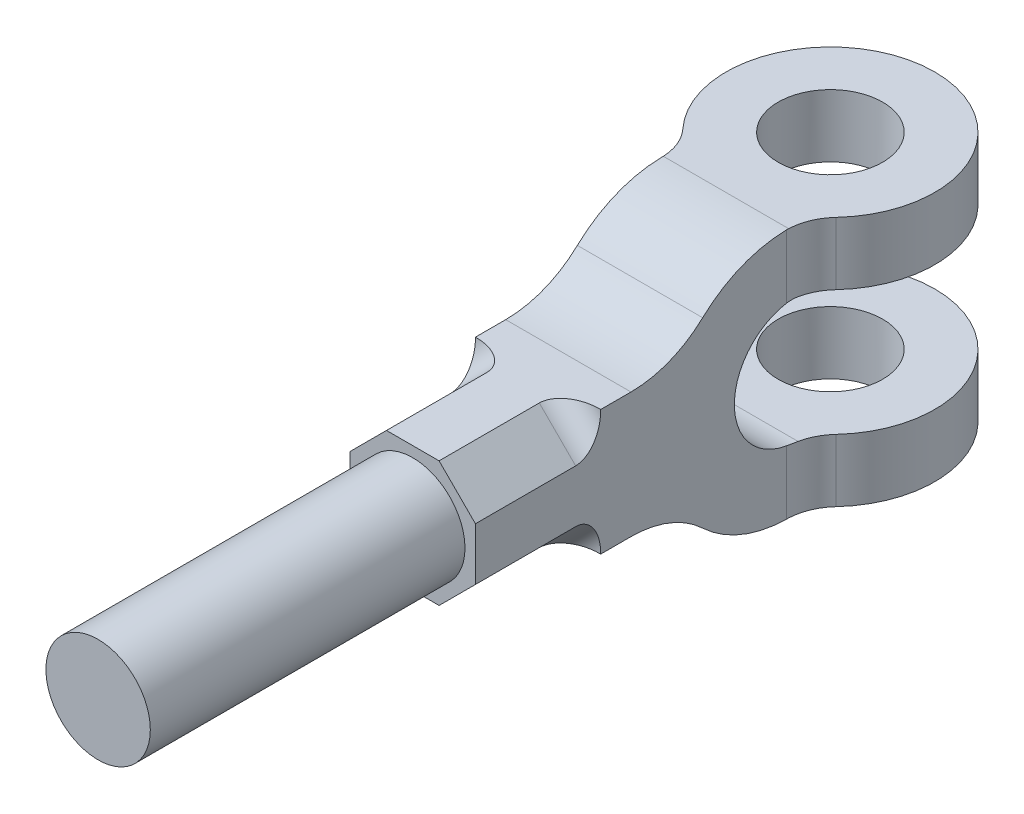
ISO-10303-21;
HEADER;
FILE_DESCRIPTION(('STEP AP214'),'2;1');
FILE_NAME('part.step','',(''),(''),'','','');
FILE_SCHEMA(('AUTOMOTIVE_DESIGN { 1 0 10303 214 1 1 1 1 }'));
ENDSEC;
DATA;
#1=APPLICATION_CONTEXT('core data for automotive mechanical design processes');
#2=APPLICATION_PROTOCOL_DEFINITION('international standard','automotive_design',2000,#1);
#3=PRODUCT_CONTEXT('',#1,'mechanical');
#4=PRODUCT('Part','Part','',(#3));
#5=PRODUCT_RELATED_PRODUCT_CATEGORY('part','',(#4));
#6=PRODUCT_DEFINITION_FORMATION('','',#4);
#7=PRODUCT_DEFINITION_CONTEXT('part definition',#1,'design');
#8=PRODUCT_DEFINITION('design','',#6,#7);
#9=PRODUCT_DEFINITION_SHAPE('','',#8);
#10=(LENGTH_UNIT() NAMED_UNIT(*) SI_UNIT(.MILLI.,.METRE.));
#11=(NAMED_UNIT(*) PLANE_ANGLE_UNIT() SI_UNIT($,.RADIAN.));
#12=(NAMED_UNIT(*) SI_UNIT($,.STERADIAN.) SOLID_ANGLE_UNIT());
#13=UNCERTAINTY_MEASURE_WITH_UNIT(LENGTH_MEASURE(1.E-05),#10,'distance_accuracy_value','');
#14=(GEOMETRIC_REPRESENTATION_CONTEXT(3) GLOBAL_UNCERTAINTY_ASSIGNED_CONTEXT((#13)) GLOBAL_UNIT_ASSIGNED_CONTEXT((#10,
#11,#12)) REPRESENTATION_CONTEXT('',''));
#15=CARTESIAN_POINT('',(0.,0.,0.));
#16=DIRECTION('',(0.,0.,1.));
#17=DIRECTION('',(1.,0.,0.));
#18=AXIS2_PLACEMENT_3D('',#15,#16,#17);
#19=CARTESIAN_POINT('',(100.,0.,250.));
#20=DIRECTION('',(0.,0.,-1.));
#21=DIRECTION('',(0.,1.,0.));
#22=AXIS2_PLACEMENT_3D('',#19,#20,#21);
#23=PLANE('',#22);
#24=CARTESIAN_POINT('',(50.,-60.,250.));
#25=DIRECTION('',(0.,0.,1.));
#26=DIRECTION('',(1.,0.,0.));
#27=AXIS2_PLACEMENT_3D('',#24,#25,#26);
#28=CIRCLE('',#27,25.);
#29=CARTESIAN_POINT('',(75.,-60.,250.));
#30=VERTEX_POINT('',#29);
#31=EDGE_CURVE('E580',#30,#30,#28,.T.);
#32=ORIENTED_EDGE('',*,*,#31,.F.);
#33=EDGE_LOOP('',(#32));
#34=FACE_BOUND('',#33,.T.);
#35=DIRECTION('',(0.707106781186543,-0.707106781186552,0.));
#36=VECTOR('',#35,1.);
#37=CARTESIAN_POINT('',(-26.3,-26.2999999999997,250.));
#38=LINE('',#37,#36);
#39=CARTESIAN_POINT('',(20.,-72.6000000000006,250.));
#40=VERTEX_POINT('',#39);
#41=CARTESIAN_POINT('',(37.3999999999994,-90.,250.));
#42=VERTEX_POINT('',#41);
#43=EDGE_CURVE('E616',#40,#42,#38,.T.);
#44=ORIENTED_EDGE('',*,*,#43,.T.);
#45=DIRECTION('',(1.,0.,0.));
#46=VECTOR('',#45,1.);
#47=CARTESIAN_POINT('',(0.,-90.,250.));
#48=LINE('',#47,#46);
#49=CARTESIAN_POINT('',(62.6000000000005,-90.,250.));
#50=VERTEX_POINT('',#49);
#51=EDGE_CURVE('E752',#42,#50,#48,.T.);
#52=ORIENTED_EDGE('',*,*,#51,.T.);
#53=DIRECTION('',(0.70710678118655,0.707106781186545,0.));
#54=VECTOR('',#53,1.);
#55=CARTESIAN_POINT('',(76.3000000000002,-76.3000000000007,250.));
#56=LINE('',#55,#54);
#57=CARTESIAN_POINT('',(80.,-72.6000000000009,250.));
#58=VERTEX_POINT('',#57);
#59=EDGE_CURVE('E604',#50,#58,#56,.T.);
#60=ORIENTED_EDGE('',*,*,#59,.T.);
#61=DIRECTION('',(0.,1.,0.));
#62=VECTOR('',#61,1.);
#63=CARTESIAN_POINT('',(80.,-120.,250.));
#64=LINE('',#63,#62);
#65=CARTESIAN_POINT('',(80.,-47.4,250.));
#66=VERTEX_POINT('',#65);
#67=EDGE_CURVE('E697',#58,#66,#64,.T.);
#68=ORIENTED_EDGE('',*,*,#67,.T.);
#69=DIRECTION('',(-0.707106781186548,0.707106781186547,0.));
#70=VECTOR('',#69,1.);
#71=CARTESIAN_POINT('',(16.3,16.3,250.));
#72=LINE('',#71,#70);
#73=CARTESIAN_POINT('',(62.6,-30.,250.));
#74=VERTEX_POINT('',#73);
#75=EDGE_CURVE('E365',#66,#74,#72,.T.);
#76=ORIENTED_EDGE('',*,*,#75,.T.);
#77=DIRECTION('',(1.,0.,0.));
#78=VECTOR('',#77,1.);
#79=CARTESIAN_POINT('',(0.,-30.,250.));
#80=LINE('',#79,#78);
#81=CARTESIAN_POINT('',(37.4000000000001,-30.,250.));
#82=VERTEX_POINT('',#81);
#83=EDGE_CURVE('E748',#82,#74,#80,.T.);
#84=ORIENTED_EDGE('',*,*,#83,.F.);
#85=DIRECTION('',(-0.707106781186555,-0.70710678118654,0.));
#86=VECTOR('',#85,1.);
#87=CARTESIAN_POINT('',(33.6999999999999,-33.7000000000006,250.));
#88=LINE('',#87,#86);
#89=CARTESIAN_POINT('',(20.,-47.4000000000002,250.));
#90=VERTEX_POINT('',#89);
#91=EDGE_CURVE('E599',#82,#90,#88,.T.);
#92=ORIENTED_EDGE('',*,*,#91,.T.);
#93=DIRECTION('',(0.,1.,0.));
#94=VECTOR('',#93,1.);
#95=CARTESIAN_POINT('',(20.,-120.,250.));
#96=LINE('',#95,#94);
#97=EDGE_CURVE('E644',#40,#90,#96,.T.);
#98=ORIENTED_EDGE('',*,*,#97,.F.);
#99=EDGE_LOOP('',(#44,#52,#60,#68,#76,#84,#92,#98));
#100=FACE_BOUND('',#99,.T.);
#101=ADVANCED_FACE('F160',(#34,#100),#23,.F.);
#102=CARTESIAN_POINT('',(0.,-90.,0.));
#103=DIRECTION('',(0.,-1.,0.));
#104=DIRECTION('',(0.,0.,-1.));
#105=AXIS2_PLACEMENT_3D('',#102,#103,#104);
#106=PLANE('',#105);
#107=ORIENTED_EDGE('',*,*,#51,.F.);
#108=DIRECTION('',(0.,0.,1.));
#109=VECTOR('',#108,1.);
#110=CARTESIAN_POINT('',(37.3999999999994,-90.,190.));
#111=LINE('',#110,#109);
#112=CARTESIAN_POINT('',(37.3999999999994,-90.,202.));
#113=VERTEX_POINT('',#112);
#114=EDGE_CURVE('E610',#113,#42,#111,.T.);
#115=ORIENTED_EDGE('',*,*,#114,.F.);
#116=CARTESIAN_POINT('',(20.4294372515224,-90.,202.));
#117=DIRECTION('',(0.,-1.,0.));
#118=DIRECTION('',(-1.,0.,0.));
#119=AXIS2_PLACEMENT_3D('',#116,#117,#118);
#120=ELLIPSE('',#119,16.970562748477,12.);
#121=CARTESIAN_POINT('',(20.4294372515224,-90.,190.));
#122=VERTEX_POINT('',#121);
#123=EDGE_CURVE('E556',#113,#122,#120,.F.);
#124=ORIENTED_EDGE('',*,*,#123,.T.);
#125=DIRECTION('',(1.,0.,0.));
#126=VECTOR('',#125,1.);
#127=CARTESIAN_POINT('',(0.,-90.,190.));
#128=LINE('',#127,#126);
#129=CARTESIAN_POINT('',(20.,-90.,190.));
#130=VERTEX_POINT('',#129);
#131=EDGE_CURVE('E615',#130,#122,#128,.T.);
#132=ORIENTED_EDGE('',*,*,#131,.F.);
#133=DIRECTION('',(0.,0.,1.));
#134=VECTOR('',#133,1.);
#135=CARTESIAN_POINT('',(20.,-90.,0.));
#136=LINE('',#135,#134);
#137=CARTESIAN_POINT('',(20.,-90.,175.498344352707));
#138=VERTEX_POINT('',#137);
#139=EDGE_CURVE('E658',#138,#130,#136,.T.);
#140=ORIENTED_EDGE('',*,*,#139,.F.);
#141=DIRECTION('',(1.,0.,0.));
#142=VECTOR('',#141,1.);
#143=CARTESIAN_POINT('',(0.,-90.,175.498344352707));
#144=LINE('',#143,#142);
#145=CARTESIAN_POINT('',(80.,-90.,175.498344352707));
#146=VERTEX_POINT('',#145);
#147=EDGE_CURVE('E391',#138,#146,#144,.T.);
#148=ORIENTED_EDGE('',*,*,#147,.T.);
#149=DIRECTION('',(0.,0.,1.));
#150=VECTOR('',#149,1.);
#151=CARTESIAN_POINT('',(80.,-90.,0.));
#152=LINE('',#151,#150);
#153=CARTESIAN_POINT('',(80.,-90.,190.));
#154=VERTEX_POINT('',#153);
#155=EDGE_CURVE('E680',#146,#154,#152,.T.);
#156=ORIENTED_EDGE('',*,*,#155,.T.);
#157=DIRECTION('',(1.,0.,0.));
#158=VECTOR('',#157,1.);
#159=CARTESIAN_POINT('',(0.,-90.,190.));
#160=LINE('',#159,#158);
#161=CARTESIAN_POINT('',(79.570562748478,-90.,190.));
#162=VERTEX_POINT('',#161);
#163=EDGE_CURVE('E601',#162,#154,#160,.T.);
#164=ORIENTED_EDGE('',*,*,#163,.F.);
#165=CARTESIAN_POINT('',(79.570562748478,-90.,202.));
#166=DIRECTION('',(0.,-1.,0.));
#167=DIRECTION('',(-1.,0.,0.));
#168=AXIS2_PLACEMENT_3D('',#165,#166,#167);
#169=ELLIPSE('',#168,16.9705627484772,12.);
#170=CARTESIAN_POINT('',(62.6000000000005,-90.,202.));
#171=VERTEX_POINT('',#170);
#172=EDGE_CURVE('E563',#162,#171,#169,.F.);
#173=ORIENTED_EDGE('',*,*,#172,.T.);
#174=DIRECTION('',(0.,0.,1.));
#175=VECTOR('',#174,1.);
#176=CARTESIAN_POINT('',(62.6000000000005,-90.,190.));
#177=LINE('',#176,#175);
#178=EDGE_CURVE('E607',#171,#50,#177,.T.);
#179=ORIENTED_EDGE('',*,*,#178,.T.);
#180=EDGE_LOOP('',(#107,#115,#124,#132,#140,#148,#156,#164,#173,#179));
#181=FACE_BOUND('',#180,.T.);
#182=ADVANCED_FACE('F512',(#181),#106,.T.);
#183=CARTESIAN_POINT('',(0.,-30.,0.));
#184=DIRECTION('',(0.,-1.,0.));
#185=DIRECTION('',(0.,0.,-1.));
#186=AXIS2_PLACEMENT_3D('',#183,#184,#185);
#187=PLANE('',#186);
#188=DIRECTION('',(0.,0.,1.));
#189=VECTOR('',#188,1.);
#190=CARTESIAN_POINT('',(62.6,-30.,190.));
#191=LINE('',#190,#189);
#192=CARTESIAN_POINT('',(62.6,-30.,202.));
#193=VERTEX_POINT('',#192);
#194=EDGE_CURVE('E597',#193,#74,#191,.T.);
#195=ORIENTED_EDGE('',*,*,#194,.F.);
#196=CARTESIAN_POINT('',(79.5705627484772,-30.,202.));
#197=DIRECTION('',(0.,-1.,0.));
#198=DIRECTION('',(1.,0.,0.));
#199=AXIS2_PLACEMENT_3D('',#196,#197,#198);
#200=ELLIPSE('',#199,16.9705627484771,12.);
#201=CARTESIAN_POINT('',(79.5705627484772,-30.,190.));
#202=VERTEX_POINT('',#201);
#203=EDGE_CURVE('E373',#193,#202,#200,.T.);
#204=ORIENTED_EDGE('',*,*,#203,.T.);
#205=DIRECTION('',(-1.,0.,0.));
#206=VECTOR('',#205,1.);
#207=CARTESIAN_POINT('',(0.,-30.,190.));
#208=LINE('',#207,#206);
#209=CARTESIAN_POINT('',(80.,-30.,190.));
#210=VERTEX_POINT('',#209);
#211=EDGE_CURVE('E359',#210,#202,#208,.T.);
#212=ORIENTED_EDGE('',*,*,#211,.F.);
#213=DIRECTION('',(0.,0.,1.));
#214=VECTOR('',#213,1.);
#215=CARTESIAN_POINT('',(80.,-30.,0.));
#216=LINE('',#215,#214);
#217=CARTESIAN_POINT('',(80.,-30.,175.498344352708));
#218=VERTEX_POINT('',#217);
#219=EDGE_CURVE('E372',#218,#210,#216,.T.);
#220=ORIENTED_EDGE('',*,*,#219,.F.);
#221=DIRECTION('',(1.,0.,0.));
#222=VECTOR('',#221,1.);
#223=CARTESIAN_POINT('',(0.,-30.,175.498344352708));
#224=LINE('',#223,#222);
#225=CARTESIAN_POINT('',(20.,-30.,175.498344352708));
#226=VERTEX_POINT('',#225);
#227=EDGE_CURVE('E746',#226,#218,#224,.T.);
#228=ORIENTED_EDGE('',*,*,#227,.F.);
#229=DIRECTION('',(0.,0.,1.));
#230=VECTOR('',#229,1.);
#231=CARTESIAN_POINT('',(20.,-30.,0.));
#232=LINE('',#231,#230);
#233=CARTESIAN_POINT('',(20.,-30.,190.));
#234=VERTEX_POINT('',#233);
#235=EDGE_CURVE('E590',#226,#234,#232,.T.);
#236=ORIENTED_EDGE('',*,*,#235,.T.);
#237=DIRECTION('',(-1.,0.,0.));
#238=VECTOR('',#237,1.);
#239=CARTESIAN_POINT('',(0.,-30.,190.));
#240=LINE('',#239,#238);
#241=CARTESIAN_POINT('',(20.4294372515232,-30.,190.));
#242=VERTEX_POINT('',#241);
#243=EDGE_CURVE('E624',#242,#234,#240,.T.);
#244=ORIENTED_EDGE('',*,*,#243,.F.);
#245=CARTESIAN_POINT('',(20.4294372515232,-30.,202.));
#246=DIRECTION('',(0.,-1.,0.));
#247=DIRECTION('',(1.,0.,0.));
#248=AXIS2_PLACEMENT_3D('',#245,#246,#247);
#249=ELLIPSE('',#248,16.9705627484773,12.);
#250=CARTESIAN_POINT('',(37.4000000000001,-30.,202.));
#251=VERTEX_POINT('',#250);
#252=EDGE_CURVE('E12',#242,#251,#249,.T.);
#253=ORIENTED_EDGE('',*,*,#252,.T.);
#254=DIRECTION('',(0.,0.,1.));
#255=VECTOR('',#254,1.);
#256=CARTESIAN_POINT('',(37.4000000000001,-30.,190.));
#257=LINE('',#256,#255);
#258=EDGE_CURVE('E628',#251,#82,#257,.T.);
#259=ORIENTED_EDGE('',*,*,#258,.T.);
#260=ORIENTED_EDGE('',*,*,#83,.T.);
#261=EDGE_LOOP('',(#195,#204,#212,#220,#228,#236,#244,#253,#259,#260));
#262=FACE_BOUND('',#261,.T.);
#263=ADVANCED_FACE('F370',(#262),#187,.F.);
#264=CARTESIAN_POINT('',(80.,-120.,0.));
#265=DIRECTION('',(1.,0.,0.));
#266=DIRECTION('',(0.,0.,-1.));
#267=AXIS2_PLACEMENT_3D('',#264,#265,#266);
#268=PLANE('',#267);
#269=ORIENTED_EDGE('',*,*,#67,.F.);
#270=DIRECTION('',(0.,0.,1.));
#271=VECTOR('',#270,1.);
#272=CARTESIAN_POINT('',(80.,-72.6000000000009,190.));
#273=LINE('',#272,#271);
#274=CARTESIAN_POINT('',(80.,-72.6000000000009,202.));
#275=VERTEX_POINT('',#274);
#276=EDGE_CURVE('E596',#275,#58,#273,.T.);
#277=ORIENTED_EDGE('',*,*,#276,.F.);
#278=CARTESIAN_POINT('',(80.,-89.570562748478,202.));
#279=DIRECTION('',(1.,0.,0.));
#280=DIRECTION('',(0.,-1.,0.));
#281=AXIS2_PLACEMENT_3D('',#278,#279,#280);
#282=ELLIPSE('',#281,16.9705627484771,12.);
#283=CARTESIAN_POINT('',(80.,-89.570562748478,190.));
#284=VERTEX_POINT('',#283);
#285=EDGE_CURVE('E565',#275,#284,#282,.F.);
#286=ORIENTED_EDGE('',*,*,#285,.T.);
#287=DIRECTION('',(0.,1.,0.));
#288=VECTOR('',#287,1.);
#289=CARTESIAN_POINT('',(80.,0.,190.));
#290=LINE('',#289,#288);
#291=EDGE_CURVE('E603',#154,#284,#290,.T.);
#292=ORIENTED_EDGE('',*,*,#291,.F.);
#293=ORIENTED_EDGE('',*,*,#155,.F.);
#294=CARTESIAN_POINT('',(80.,-140.,175.498344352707));
#295=DIRECTION('',(1.,0.,0.));
#296=DIRECTION('',(0.,0.,-1.));
#297=AXIS2_PLACEMENT_3D('',#294,#295,#296);
#298=CIRCLE('',#297,50.);
#299=CARTESIAN_POINT('',(80.,-103.636363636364,141.180915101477));
#300=VERTEX_POINT('',#299);
#301=EDGE_CURVE('E677',#300,#146,#298,.T.);
#302=ORIENTED_EDGE('',*,*,#301,.F.);
#303=CARTESIAN_POINT('',(80.,-60.,100.));
#304=DIRECTION('',(1.,0.,0.));
#305=DIRECTION('',(0.,0.,-1.));
#306=AXIS2_PLACEMENT_3D('',#303,#304,#305);
#307=CIRCLE('',#306,60.);
#308=CARTESIAN_POINT('',(80.,-119.991828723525,100.990195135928));
#309=VERTEX_POINT('',#308);
#310=EDGE_CURVE('E672',#309,#300,#307,.F.);
#311=ORIENTED_EDGE('',*,*,#310,.F.);
#312=DIRECTION('',(0.,1.,0.));
#313=VECTOR('',#312,1.);
#314=CARTESIAN_POINT('',(80.,-120.,100.990195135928));
#315=LINE('',#314,#313);
#316=CARTESIAN_POINT('',(80.,-89.5820545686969,100.990195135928));
#317=VERTEX_POINT('',#316);
#318=EDGE_CURVE('E695',#309,#317,#315,.T.);
#319=ORIENTED_EDGE('',*,*,#318,.T.);
#320=CARTESIAN_POINT('',(80.,-60.,96.));
#321=DIRECTION('',(1.,0.,0.));
#322=DIRECTION('',(0.,0.,-1.));
#323=AXIS2_PLACEMENT_3D('',#320,#321,#322);
#324=CIRCLE('',#323,30.);
#325=CARTESIAN_POINT('',(80.,-30.4179454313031,100.990195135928));
#326=VERTEX_POINT('',#325);
#327=EDGE_CURVE('E685',#317,#326,#324,.F.);
#328=ORIENTED_EDGE('',*,*,#327,.T.);
#329=CARTESIAN_POINT('',(80.,-0.00817127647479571,100.990195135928));
#330=VERTEX_POINT('',#329);
#331=EDGE_CURVE('E692',#326,#330,#315,.T.);
#332=ORIENTED_EDGE('',*,*,#331,.T.);
#333=CARTESIAN_POINT('',(80.,-60.,100.));
#334=DIRECTION('',(1.,0.,0.));
#335=DIRECTION('',(0.,0.,-1.));
#336=AXIS2_PLACEMENT_3D('',#333,#334,#335);
#337=CIRCLE('',#336,60.);
#338=CARTESIAN_POINT('',(80.,-16.3636363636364,141.180915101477));
#339=VERTEX_POINT('',#338);
#340=EDGE_CURVE('E687',#339,#330,#337,.F.);
#341=ORIENTED_EDGE('',*,*,#340,.F.);
#342=CARTESIAN_POINT('',(80.,20.,175.498344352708));
#343=DIRECTION('',(1.,0.,0.));
#344=DIRECTION('',(0.,0.,-1.));
#345=AXIS2_PLACEMENT_3D('',#342,#343,#344);
#346=CIRCLE('',#345,50.);
#347=EDGE_CURVE('E381',#339,#218,#346,.F.);
#348=ORIENTED_EDGE('',*,*,#347,.T.);
#349=ORIENTED_EDGE('',*,*,#219,.T.);
#350=DIRECTION('',(0.,1.,0.));
#351=VECTOR('',#350,1.);
#352=CARTESIAN_POINT('',(80.,0.,190.));
#353=LINE('',#352,#351);
#354=CARTESIAN_POINT('',(80.,-30.4294372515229,190.));
#355=VERTEX_POINT('',#354);
#356=EDGE_CURVE('E356',#355,#210,#353,.T.);
#357=ORIENTED_EDGE('',*,*,#356,.F.);
#358=CARTESIAN_POINT('',(80.,-30.4294372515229,202.));
#359=DIRECTION('',(1.,0.,0.));
#360=DIRECTION('',(0.,-1.,0.));
#361=AXIS2_PLACEMENT_3D('',#358,#359,#360);
#362=ELLIPSE('',#361,16.9705627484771,12.);
#363=CARTESIAN_POINT('',(80.,-47.4,202.));
#364=VERTEX_POINT('',#363);
#365=EDGE_CURVE('E558',#355,#364,#362,.F.);
#366=ORIENTED_EDGE('',*,*,#365,.T.);
#367=DIRECTION('',(0.,0.,1.));
#368=VECTOR('',#367,1.);
#369=CARTESIAN_POINT('',(80.,-47.4,190.));
#370=LINE('',#369,#368);
#371=EDGE_CURVE('E374',#364,#66,#370,.T.);
#372=ORIENTED_EDGE('',*,*,#371,.T.);
#373=EDGE_LOOP('',(#269,#277,#286,#292,#293,#302,#311,#319,#328,#332,#341,#348,#349,#357,#366,#372));
#374=FACE_BOUND('',#373,.T.);
#375=ADVANCED_FACE('F378',(#374),#268,.T.);
#376=CARTESIAN_POINT('',(20.,-120.,0.));
#377=DIRECTION('',(1.,0.,0.));
#378=DIRECTION('',(0.,0.,-1.));
#379=AXIS2_PLACEMENT_3D('',#376,#377,#378);
#380=PLANE('',#379);
#381=DIRECTION('',(0.,-1.,0.));
#382=VECTOR('',#381,1.);
#383=CARTESIAN_POINT('',(20.,0.,190.));
#384=LINE('',#383,#382);
#385=CARTESIAN_POINT('',(20.,-89.5705627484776,190.));
#386=VERTEX_POINT('',#385);
#387=EDGE_CURVE('E613',#386,#130,#384,.T.);
#388=ORIENTED_EDGE('',*,*,#387,.F.);
#389=CARTESIAN_POINT('',(20.,-89.5705627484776,202.));
#390=DIRECTION('',(1.,0.,0.));
#391=DIRECTION('',(0.,1.,0.));
#392=AXIS2_PLACEMENT_3D('',#389,#390,#391);
#393=ELLIPSE('',#392,16.9705627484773,12.);
#394=CARTESIAN_POINT('',(20.,-72.6000000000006,202.));
#395=VERTEX_POINT('',#394);
#396=EDGE_CURVE('E550',#386,#395,#393,.T.);
#397=ORIENTED_EDGE('',*,*,#396,.T.);
#398=DIRECTION('',(0.,0.,1.));
#399=VECTOR('',#398,1.);
#400=CARTESIAN_POINT('',(20.,-72.6000000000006,190.));
#401=LINE('',#400,#399);
#402=EDGE_CURVE('E619',#395,#40,#401,.T.);
#403=ORIENTED_EDGE('',*,*,#402,.T.);
#404=ORIENTED_EDGE('',*,*,#97,.T.);
#405=DIRECTION('',(0.,0.,1.));
#406=VECTOR('',#405,1.);
#407=CARTESIAN_POINT('',(20.,-47.4000000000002,190.));
#408=LINE('',#407,#406);
#409=CARTESIAN_POINT('',(20.,-47.4000000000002,202.));
#410=VERTEX_POINT('',#409);
#411=EDGE_CURVE('E631',#410,#90,#408,.T.);
#412=ORIENTED_EDGE('',*,*,#411,.F.);
#413=CARTESIAN_POINT('',(20.,-30.4294372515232,202.));
#414=DIRECTION('',(1.,0.,0.));
#415=DIRECTION('',(0.,1.,0.));
#416=AXIS2_PLACEMENT_3D('',#413,#414,#415);
#417=ELLIPSE('',#416,16.970562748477,12.);
#418=CARTESIAN_POINT('',(20.,-30.4294372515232,190.));
#419=VERTEX_POINT('',#418);
#420=EDGE_CURVE('E168',#410,#419,#417,.T.);
#421=ORIENTED_EDGE('',*,*,#420,.T.);
#422=DIRECTION('',(0.,-1.,0.));
#423=VECTOR('',#422,1.);
#424=CARTESIAN_POINT('',(20.,0.,190.));
#425=LINE('',#424,#423);
#426=EDGE_CURVE('E626',#234,#419,#425,.T.);
#427=ORIENTED_EDGE('',*,*,#426,.F.);
#428=ORIENTED_EDGE('',*,*,#235,.F.);
#429=CARTESIAN_POINT('',(20.,20.,175.498344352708));
#430=DIRECTION('',(1.,0.,0.));
#431=DIRECTION('',(0.,0.,-1.));
#432=AXIS2_PLACEMENT_3D('',#429,#430,#431);
#433=CIRCLE('',#432,50.);
#434=CARTESIAN_POINT('',(20.,-16.3636363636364,141.180915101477));
#435=VERTEX_POINT('',#434);
#436=EDGE_CURVE('E650',#435,#226,#433,.F.);
#437=ORIENTED_EDGE('',*,*,#436,.F.);
#438=CARTESIAN_POINT('',(20.,-60.,100.));
#439=DIRECTION('',(1.,0.,0.));
#440=DIRECTION('',(0.,0.,-1.));
#441=AXIS2_PLACEMENT_3D('',#438,#439,#440);
#442=CIRCLE('',#441,60.);
#443=CARTESIAN_POINT('',(20.,-0.00817127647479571,100.990195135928));
#444=VERTEX_POINT('',#443);
#445=EDGE_CURVE('E653',#435,#444,#442,.F.);
#446=ORIENTED_EDGE('',*,*,#445,.T.);
#447=DIRECTION('',(0.,1.,0.));
#448=VECTOR('',#447,1.);
#449=CARTESIAN_POINT('',(20.,-120.,100.990195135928));
#450=LINE('',#449,#448);
#451=CARTESIAN_POINT('',(20.,-30.4179454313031,100.990195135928));
#452=VERTEX_POINT('',#451);
#453=EDGE_CURVE('E640',#452,#444,#450,.T.);
#454=ORIENTED_EDGE('',*,*,#453,.F.);
#455=CARTESIAN_POINT('',(20.,-60.,96.));
#456=DIRECTION('',(1.,0.,0.));
#457=DIRECTION('',(0.,0.,-1.));
#458=AXIS2_PLACEMENT_3D('',#455,#456,#457);
#459=CIRCLE('',#458,30.);
#460=CARTESIAN_POINT('',(20.,-89.5820545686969,100.990195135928));
#461=VERTEX_POINT('',#460);
#462=EDGE_CURVE('E655',#461,#452,#459,.F.);
#463=ORIENTED_EDGE('',*,*,#462,.F.);
#464=CARTESIAN_POINT('',(20.,-119.991828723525,100.990195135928));
#465=VERTEX_POINT('',#464);
#466=EDGE_CURVE('E643',#465,#461,#450,.T.);
#467=ORIENTED_EDGE('',*,*,#466,.F.);
#468=CARTESIAN_POINT('',(20.,-60.,100.));
#469=DIRECTION('',(1.,0.,0.));
#470=DIRECTION('',(0.,0.,-1.));
#471=AXIS2_PLACEMENT_3D('',#468,#469,#470);
#472=CIRCLE('',#471,60.);
#473=CARTESIAN_POINT('',(20.,-103.636363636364,141.180915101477));
#474=VERTEX_POINT('',#473);
#475=EDGE_CURVE('E465',#465,#474,#472,.F.);
#476=ORIENTED_EDGE('',*,*,#475,.T.);
#477=CARTESIAN_POINT('',(20.,-140.,175.498344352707));
#478=DIRECTION('',(1.,0.,0.));
#479=DIRECTION('',(0.,0.,-1.));
#480=AXIS2_PLACEMENT_3D('',#477,#478,#479);
#481=CIRCLE('',#480,50.);
#482=EDGE_CURVE('E660',#474,#138,#481,.T.);
#483=ORIENTED_EDGE('',*,*,#482,.T.);
#484=ORIENTED_EDGE('',*,*,#139,.T.);
#485=EDGE_LOOP('',(#388,#397,#403,#404,#412,#421,#427,#428,#437,#446,#454,#463,#467,#476,#483,#484));
#486=FACE_BOUND('',#485,.T.);
#487=ADVANCED_FACE('F475',(#486),#380,.F.);
#488=CARTESIAN_POINT('',(100.,-120.,0.));
#489=DIRECTION('',(0.,1.,0.));
#490=DIRECTION('',(0.,0.,1.));
#491=AXIS2_PLACEMENT_3D('',#488,#489,#490);
#492=PLANE('',#491);
#493=CARTESIAN_POINT('',(50.,-120.,50.));
#494=DIRECTION('',(0.,1.,0.));
#495=DIRECTION('',(0.,0.,1.));
#496=AXIS2_PLACEMENT_3D('',#493,#494,#495);
#497=CIRCLE('',#496,25.);
#498=CARTESIAN_POINT('',(50.,-120.,75.));
#499=VERTEX_POINT('',#498);
#500=EDGE_CURVE('E506',#499,#499,#497,.T.);
#501=ORIENTED_EDGE('',*,*,#500,.T.);
#502=EDGE_LOOP('',(#501));
#503=FACE_BOUND('',#502,.T.);
#504=CARTESIAN_POINT('',(-4.99999999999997,-120.,100.990195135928));
#505=DIRECTION('',(0.,1.,0.));
#506=DIRECTION('',(0.,0.,1.));
#507=AXIS2_PLACEMENT_3D('',#504,#505,#506);
#508=CIRCLE('',#507,25.);
#509=CARTESIAN_POINT('',(13.3333333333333,-120.,83.9934634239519));
#510=VERTEX_POINT('',#509);
#511=CARTESIAN_POINT('',(19.9803825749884,-120.,100.));
#512=VERTEX_POINT('',#511);
#513=EDGE_CURVE('E635',#510,#512,#508,.F.);
#514=ORIENTED_EDGE('',*,*,#513,.F.);
#515=CARTESIAN_POINT('',(50.,-120.,50.));
#516=DIRECTION('',(0.,1.,0.));
#517=DIRECTION('',(0.,0.,1.));
#518=AXIS2_PLACEMENT_3D('',#515,#516,#517);
#519=CIRCLE('',#518,50.);
#520=CARTESIAN_POINT('',(86.6666666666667,-120.,83.9934634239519));
#521=VERTEX_POINT('',#520);
#522=EDGE_CURVE('E696',#521,#510,#519,.T.);
#523=ORIENTED_EDGE('',*,*,#522,.F.);
#524=CARTESIAN_POINT('',(105.,-120.,100.990195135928));
#525=DIRECTION('',(0.,1.,0.));
#526=DIRECTION('',(0.,0.,1.));
#527=AXIS2_PLACEMENT_3D('',#524,#525,#526);
#528=CIRCLE('',#527,25.);
#529=CARTESIAN_POINT('',(80.0196174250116,-120.,100.));
#530=VERTEX_POINT('',#529);
#531=EDGE_CURVE('E705',#530,#521,#528,.F.);
#532=ORIENTED_EDGE('',*,*,#531,.F.);
#533=DIRECTION('',(1.,0.,0.));
#534=VECTOR('',#533,1.);
#535=CARTESIAN_POINT('',(0.,-120.,100.));
#536=LINE('',#535,#534);
#537=EDGE_CURVE('E388',#512,#530,#536,.T.);
#538=ORIENTED_EDGE('',*,*,#537,.F.);
#539=EDGE_LOOP('',(#514,#523,#532,#538));
#540=FACE_BOUND('',#539,.T.);
#541=ADVANCED_FACE('F521',(#503,#540),#492,.F.);
#542=CARTESIAN_POINT('',(100.,0.,0.));
#543=DIRECTION('',(0.,-1.,0.));
#544=DIRECTION('',(0.,0.,-1.));
#545=AXIS2_PLACEMENT_3D('',#542,#543,#544);
#546=PLANE('',#545);
#547=CARTESIAN_POINT('',(50.,0.,50.));
#548=DIRECTION('',(0.,1.,0.));
#549=DIRECTION('',(0.,0.,1.));
#550=AXIS2_PLACEMENT_3D('',#547,#548,#549);
#551=CIRCLE('',#550,25.);
#552=CARTESIAN_POINT('',(50.,0.,75.));
#553=VERTEX_POINT('',#552);
#554=EDGE_CURVE('E505',#553,#553,#551,.T.);
#555=ORIENTED_EDGE('',*,*,#554,.F.);
#556=EDGE_LOOP('',(#555));
#557=FACE_BOUND('',#556,.T.);
#558=CARTESIAN_POINT('',(-4.99999999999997,0.,100.990195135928));
#559=DIRECTION('',(0.,1.,0.));
#560=DIRECTION('',(0.,0.,1.));
#561=AXIS2_PLACEMENT_3D('',#558,#559,#560);
#562=CIRCLE('',#561,25.);
#563=CARTESIAN_POINT('',(13.3333333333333,0.,83.9934634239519));
#564=VERTEX_POINT('',#563);
#565=CARTESIAN_POINT('',(19.9803825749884,0.,100.));
#566=VERTEX_POINT('',#565);
#567=EDGE_CURVE('E633',#564,#566,#562,.F.);
#568=ORIENTED_EDGE('',*,*,#567,.T.);
#569=DIRECTION('',(1.,0.,0.));
#570=VECTOR('',#569,1.);
#571=CARTESIAN_POINT('',(0.,0.,100.));
#572=LINE('',#571,#570);
#573=CARTESIAN_POINT('',(80.0196174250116,0.,100.));
#574=VERTEX_POINT('',#573);
#575=EDGE_CURVE('E740',#566,#574,#572,.T.);
#576=ORIENTED_EDGE('',*,*,#575,.T.);
#577=CARTESIAN_POINT('',(105.,0.,100.990195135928));
#578=DIRECTION('',(0.,1.,0.));
#579=DIRECTION('',(0.,0.,1.));
#580=AXIS2_PLACEMENT_3D('',#577,#578,#579);
#581=CIRCLE('',#580,25.);
#582=CARTESIAN_POINT('',(86.6666666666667,0.,83.9934634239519));
#583=VERTEX_POINT('',#582);
#584=EDGE_CURVE('E706',#574,#583,#581,.F.);
#585=ORIENTED_EDGE('',*,*,#584,.T.);
#586=CARTESIAN_POINT('',(50.,0.,50.));
#587=DIRECTION('',(0.,1.,0.));
#588=DIRECTION('',(0.,0.,1.));
#589=AXIS2_PLACEMENT_3D('',#586,#587,#588);
#590=CIRCLE('',#589,50.);
#591=EDGE_CURVE('E703',#583,#564,#590,.T.);
#592=ORIENTED_EDGE('',*,*,#591,.T.);
#593=EDGE_LOOP('',(#568,#576,#585,#592));
#594=FACE_BOUND('',#593,.T.);
#595=ADVANCED_FACE('F524',(#557,#594),#546,.F.);
#596=CARTESIAN_POINT('',(0.,-30.,0.));
#597=DIRECTION('',(0.,-1.,0.));
#598=DIRECTION('',(0.,0.,-1.));
#599=AXIS2_PLACEMENT_3D('',#596,#597,#598);
#600=PLANE('',#599);
#601=CARTESIAN_POINT('',(50.,-30.,50.));
#602=DIRECTION('',(0.,-1.,0.));
#603=DIRECTION('',(0.,0.,-1.));
#604=AXIS2_PLACEMENT_3D('',#601,#602,#603);
#605=CIRCLE('',#604,25.);
#606=CARTESIAN_POINT('',(50.,-30.,25.));
#607=VERTEX_POINT('',#606);
#608=EDGE_CURVE('E709',#607,#607,#605,.T.);
#609=ORIENTED_EDGE('',*,*,#608,.F.);
#610=EDGE_LOOP('',(#609));
#611=FACE_BOUND('',#610,.T.);
#612=DIRECTION('',(1.,0.,0.));
#613=VECTOR('',#612,1.);
#614=CARTESIAN_POINT('',(0.,-30.,96.));
#615=LINE('',#614,#613);
#616=CARTESIAN_POINT('',(19.496896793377,-30.,96.));
#617=VERTEX_POINT('',#616);
#618=CARTESIAN_POINT('',(80.503103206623,-30.,96.));
#619=VERTEX_POINT('',#618);
#620=EDGE_CURVE('E737',#617,#619,#615,.T.);
#621=ORIENTED_EDGE('',*,*,#620,.F.);
#622=CARTESIAN_POINT('',(-4.99999999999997,-30.,100.990195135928));
#623=DIRECTION('',(0.,-1.,0.));
#624=DIRECTION('',(0.,0.,-1.));
#625=AXIS2_PLACEMENT_3D('',#622,#623,#624);
#626=CIRCLE('',#625,25.);
#627=CARTESIAN_POINT('',(13.3333333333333,-30.,83.9934634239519));
#628=VERTEX_POINT('',#627);
#629=EDGE_CURVE('E496',#617,#628,#626,.F.);
#630=ORIENTED_EDGE('',*,*,#629,.T.);
#631=CARTESIAN_POINT('',(50.,-30.,50.));
#632=DIRECTION('',(0.,-1.,0.));
#633=DIRECTION('',(0.,0.,-1.));
#634=AXIS2_PLACEMENT_3D('',#631,#632,#633);
#635=CIRCLE('',#634,50.);
#636=CARTESIAN_POINT('',(86.6666666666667,-30.,83.9934634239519));
#637=VERTEX_POINT('',#636);
#638=EDGE_CURVE('E738',#628,#637,#635,.T.);
#639=ORIENTED_EDGE('',*,*,#638,.T.);
#640=CARTESIAN_POINT('',(105.,-30.,100.990195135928));
#641=DIRECTION('',(0.,-1.,0.));
#642=DIRECTION('',(0.,0.,-1.));
#643=AXIS2_PLACEMENT_3D('',#640,#641,#642);
#644=CIRCLE('',#643,25.);
#645=EDGE_CURVE('E437',#637,#619,#644,.F.);
#646=ORIENTED_EDGE('',*,*,#645,.T.);
#647=EDGE_LOOP('',(#621,#630,#639,#646));
#648=FACE_BOUND('',#647,.T.);
#649=ADVANCED_FACE('F414',(#611,#648),#600,.T.);
#650=CARTESIAN_POINT('',(0.,-90.,0.));
#651=DIRECTION('',(0.,-1.,0.));
#652=DIRECTION('',(0.,0.,-1.));
#653=AXIS2_PLACEMENT_3D('',#650,#651,#652);
#654=PLANE('',#653);
#655=CARTESIAN_POINT('',(50.,-90.,50.));
#656=DIRECTION('',(0.,-1.,0.));
#657=DIRECTION('',(0.,0.,-1.));
#658=AXIS2_PLACEMENT_3D('',#655,#656,#657);
#659=CIRCLE('',#658,25.);
#660=CARTESIAN_POINT('',(50.,-90.,25.));
#661=VERTEX_POINT('',#660);
#662=EDGE_CURVE('E713',#661,#661,#659,.T.);
#663=ORIENTED_EDGE('',*,*,#662,.T.);
#664=EDGE_LOOP('',(#663));
#665=FACE_BOUND('',#664,.T.);
#666=CARTESIAN_POINT('',(-4.99999999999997,-90.,100.990195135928));
#667=DIRECTION('',(0.,-1.,0.));
#668=DIRECTION('',(0.,0.,-1.));
#669=AXIS2_PLACEMENT_3D('',#666,#667,#668);
#670=CIRCLE('',#669,25.);
#671=CARTESIAN_POINT('',(19.496896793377,-90.,96.));
#672=VERTEX_POINT('',#671);
#673=CARTESIAN_POINT('',(13.3333333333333,-90.,83.9934634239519));
#674=VERTEX_POINT('',#673);
#675=EDGE_CURVE('E464',#672,#674,#670,.F.);
#676=ORIENTED_EDGE('',*,*,#675,.F.);
#677=DIRECTION('',(1.,0.,0.));
#678=VECTOR('',#677,1.);
#679=CARTESIAN_POINT('',(0.,-90.,96.));
#680=LINE('',#679,#678);
#681=CARTESIAN_POINT('',(80.503103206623,-90.,96.));
#682=VERTEX_POINT('',#681);
#683=EDGE_CURVE('E735',#672,#682,#680,.T.);
#684=ORIENTED_EDGE('',*,*,#683,.T.);
#685=CARTESIAN_POINT('',(105.,-90.,100.990195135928));
#686=DIRECTION('',(0.,-1.,0.));
#687=DIRECTION('',(0.,0.,-1.));
#688=AXIS2_PLACEMENT_3D('',#685,#686,#687);
#689=CIRCLE('',#688,25.);
#690=CARTESIAN_POINT('',(86.6666666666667,-90.,83.9934634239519));
#691=VERTEX_POINT('',#690);
#692=EDGE_CURVE('E676',#691,#682,#689,.F.);
#693=ORIENTED_EDGE('',*,*,#692,.F.);
#694=CARTESIAN_POINT('',(50.,-90.,50.));
#695=DIRECTION('',(0.,-1.,0.));
#696=DIRECTION('',(0.,0.,-1.));
#697=AXIS2_PLACEMENT_3D('',#694,#695,#696);
#698=CIRCLE('',#697,50.);
#699=EDGE_CURVE('E386',#674,#691,#698,.T.);
#700=ORIENTED_EDGE('',*,*,#699,.F.);
#701=EDGE_LOOP('',(#676,#684,#693,#700));
#702=FACE_BOUND('',#701,.T.);
#703=ADVANCED_FACE('F449',(#665,#702),#654,.F.);
#704=CARTESIAN_POINT('',(0.,-60.,100.));
#705=DIRECTION('',(1.,0.,0.));
#706=DIRECTION('',(0.,0.,-1.));
#707=AXIS2_PLACEMENT_3D('',#704,#705,#706);
#708=CYLINDRICAL_SURFACE('',#707,60.);
#709=ORIENTED_EDGE('',*,*,#475,.F.);
#710=CARTESIAN_POINT('',(20.,-119.991828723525,100.990195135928));
#711=CARTESIAN_POINT('',(19.9999999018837,-119.994552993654,100.825109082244));
#712=CARTESIAN_POINT('',(19.9983650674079,-119.996596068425,100.660049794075));
#713=CARTESIAN_POINT('',(19.9918259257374,-119.99931982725,100.329984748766));
#714=CARTESIAN_POINT('',(19.9869216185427,-120.000000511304,100.164978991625));
#715=CARTESIAN_POINT('',(19.9803825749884,-120.,100.));
#716=B_SPLINE_CURVE_WITH_KNOTS('',3,(#710,#711,#712,#713,#714,#715),.UNSPECIFIED.,.F.,.F.,(4,2,
4),(0.,0.495240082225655,0.990480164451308),.UNSPECIFIED.);
#717=EDGE_CURVE('E498',#465,#512,#716,.T.);
#718=ORIENTED_EDGE('',*,*,#717,.T.);
#719=ORIENTED_EDGE('',*,*,#537,.T.);
#720=CARTESIAN_POINT('',(80.0196174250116,-120.,100.));
#721=CARTESIAN_POINT('',(80.0130783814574,-120.000000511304,100.164978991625));
#722=CARTESIAN_POINT('',(80.0081740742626,-119.99931982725,100.329984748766));
#723=CARTESIAN_POINT('',(80.0016349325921,-119.996596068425,100.660049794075));
#724=CARTESIAN_POINT('',(80.0000000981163,-119.994552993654,100.825109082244));
#725=CARTESIAN_POINT('',(80.,-119.991828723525,100.990195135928));
#726=B_SPLINE_CURVE_WITH_KNOTS('',3,(#720,#721,#722,#723,#724,#725),.UNSPECIFIED.,.F.,.F.,(4,2,
4),(0.,0.495240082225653,0.990480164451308),.UNSPECIFIED.);
#727=EDGE_CURVE('E436',#530,#309,#726,.T.);
#728=ORIENTED_EDGE('',*,*,#727,.T.);
#729=ORIENTED_EDGE('',*,*,#310,.T.);
#730=DIRECTION('',(1.,0.,0.));
#731=VECTOR('',#730,1.);
#732=CARTESIAN_POINT('',(0.,-103.636363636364,141.180915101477));
#733=LINE('',#732,#731);
#734=EDGE_CURVE('E383',#474,#300,#733,.T.);
#735=ORIENTED_EDGE('',*,*,#734,.F.);
#736=EDGE_LOOP('',(#709,#718,#719,#728,#729,#735));
#737=FACE_BOUND('',#736,.T.);
#738=ADVANCED_FACE('F447',(#737),#708,.T.);
#739=CARTESIAN_POINT('',(0.,-60.,96.));
#740=DIRECTION('',(1.,0.,0.));
#741=DIRECTION('',(0.,0.,-1.));
#742=AXIS2_PLACEMENT_3D('',#739,#740,#741);
#743=CYLINDRICAL_SURFACE('',#742,30.);
#744=CARTESIAN_POINT('',(13.3333333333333,-32.5073995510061,83.9934634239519));
#745=CARTESIAN_POINT('',(13.7442372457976,-32.3138021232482,84.4366765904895));
#746=CARTESIAN_POINT('',(14.1404223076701,-32.125893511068,84.8962609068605));
#747=CARTESIAN_POINT('',(14.901295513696,-31.7656351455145,85.8472237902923));
#748=CARTESIAN_POINT('',(15.2659560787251,-31.5932990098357,86.3386295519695));
#749=CARTESIAN_POINT('',(15.9634404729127,-31.2675780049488,87.3550699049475));
#750=CARTESIAN_POINT('',(16.296022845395,-31.1143346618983,87.880316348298));
#751=CARTESIAN_POINT('',(16.9235262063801,-30.8326250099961,88.9590600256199));
#752=CARTESIAN_POINT('',(17.2184574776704,-30.7041519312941,89.5125494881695));
#753=CARTESIAN_POINT('',(17.7695633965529,-30.4754236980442,90.6486292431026));
#754=CARTESIAN_POINT('',(18.0254839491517,-30.3753501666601,91.2313799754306));
#755=CARTESIAN_POINT('',(18.4934601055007,-30.208452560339,92.4190391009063));
#756=CARTESIAN_POINT('',(18.705508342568,-30.1416340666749,93.0239511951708));
#757=CARTESIAN_POINT('',(19.0822286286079,-30.0449269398,94.2482031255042));
#758=CARTESIAN_POINT('',(19.2471162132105,-30.0148681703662,94.8674628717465));
#759=CARTESIAN_POINT('',(19.5288301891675,-29.9937241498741,96.117153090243));
#760=CARTESIAN_POINT('',(19.6456824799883,-30.0026178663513,96.7475773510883));
#761=CARTESIAN_POINT('',(19.8256095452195,-30.0594364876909,97.9807516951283));
#762=CARTESIAN_POINT('',(19.8911715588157,-30.1053012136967,98.5832299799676));
#763=CARTESIAN_POINT('',(19.9565780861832,-30.2017526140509,99.4866241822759));
#764=CARTESIAN_POINT('',(19.9728906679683,-30.2385549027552,99.7879558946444));
#765=CARTESIAN_POINT('',(19.9946050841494,-30.3213596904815,100.389833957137));
#766=CARTESIAN_POINT('',(20.000003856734,-30.36736476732,100.690380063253));
#767=CARTESIAN_POINT('',(20.,-30.4179454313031,100.990195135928));
#768=B_SPLINE_CURVE_WITH_KNOTS('',3,(#744,#745,#746,#747,#748,#749,#750,#751,#752,#753,#754,
#755,#756,#757,#758,#759,#760,#761,#762,#763,#764,#765,#766,#767),.UNSPECIFIED.,.F.,.F.,(4,2,2,
2,2,2,2,2,2,2,2,4),(0.,1.90374836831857,3.80914571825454,5.72791855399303,7.64616623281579,
9.5764185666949,11.5069947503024,13.4286013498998,15.349170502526,17.1695572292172,
18.0812908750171,18.993280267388),.UNSPECIFIED.);
#769=EDGE_CURVE('E490',#617,#452,#768,.T.);
#770=ORIENTED_EDGE('',*,*,#769,.F.);
#771=ORIENTED_EDGE('',*,*,#620,.T.);
#772=CARTESIAN_POINT('',(80.,-30.4179454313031,100.990195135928));
#773=CARTESIAN_POINT('',(79.9999660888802,-30.3478000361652,100.574583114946));
#774=CARTESIAN_POINT('',(80.0103641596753,-30.2864816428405,100.157472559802));
#775=CARTESIAN_POINT('',(80.0521278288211,-30.1817646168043,99.323857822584));
#776=CARTESIAN_POINT('',(80.0834042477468,-30.1382910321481,98.9073585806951));
#777=CARTESIAN_POINT('',(80.167025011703,-30.0689335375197,98.0750109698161));
#778=CARTESIAN_POINT('',(80.2193693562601,-30.0430496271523,97.6591626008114));
#779=CARTESIAN_POINT('',(80.3452806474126,-30.0085286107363,96.8281523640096));
#780=CARTESIAN_POINT('',(80.4189371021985,-29.9999654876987,96.4130009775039));
#781=CARTESIAN_POINT('',(80.503103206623,-30.,96.));
#782=B_SPLINE_CURVE_WITH_KNOTS('',3,(#772,#773,#774,#775,#776,#777,#778,#779,#780,#781),
.UNSPECIFIED.,.F.,.F.,(4,2,2,2,4),(0.,1.26425935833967,2.52315284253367,3.78204629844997,
5.04630565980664),.UNSPECIFIED.);
#783=EDGE_CURVE('E430',#326,#619,#782,.T.);
#784=ORIENTED_EDGE('',*,*,#783,.F.);
#785=ORIENTED_EDGE('',*,*,#327,.F.);
#786=CARTESIAN_POINT('',(80.503103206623,-89.9999999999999,96.));
#787=CARTESIAN_POINT('',(80.4189371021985,-90.0000345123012,96.4130009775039));
#788=CARTESIAN_POINT('',(80.3452806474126,-89.9914713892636,96.8281523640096));
#789=CARTESIAN_POINT('',(80.2193693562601,-89.9569503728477,97.6591626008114));
#790=CARTESIAN_POINT('',(80.167025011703,-89.9310664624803,98.0750109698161));
#791=CARTESIAN_POINT('',(80.0834042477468,-89.8617089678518,98.9073585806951));
#792=CARTESIAN_POINT('',(80.0521278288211,-89.8182353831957,99.323857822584));
#793=CARTESIAN_POINT('',(80.0103641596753,-89.7135183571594,100.157472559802));
#794=CARTESIAN_POINT('',(79.9999660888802,-89.6521999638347,100.574583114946));
#795=CARTESIAN_POINT('',(80.,-89.5820545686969,100.990195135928));
#796=B_SPLINE_CURVE_WITH_KNOTS('',3,(#786,#787,#788,#789,#790,#791,#792,#793,#794,#795),
.UNSPECIFIED.,.F.,.F.,(4,2,2,2,4),(0.,1.26425936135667,2.52315281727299,3.78204630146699,
5.04630565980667),.UNSPECIFIED.);
#797=EDGE_CURVE('E421',#682,#317,#796,.T.);
#798=ORIENTED_EDGE('',*,*,#797,.F.);
#799=ORIENTED_EDGE('',*,*,#683,.F.);
#800=CARTESIAN_POINT('',(20.,-89.5820545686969,100.990195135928));
#801=CARTESIAN_POINT('',(20.0000027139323,-89.6298262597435,100.707023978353));
#802=CARTESIAN_POINT('',(19.9951874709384,-89.673517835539,100.423200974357));
#803=CARTESIAN_POINT('',(19.9758210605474,-89.7527016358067,99.8547480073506));
#804=CARTESIAN_POINT('',(19.9612699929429,-89.7881939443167,99.5701180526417));
#805=CARTESIAN_POINT('',(19.9028833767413,-89.8822816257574,98.7160537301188));
#806=CARTESIAN_POINT('',(19.8443146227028,-89.9285380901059,98.1461459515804));
#807=CARTESIAN_POINT('',(19.6884066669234,-89.9881592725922,97.0144541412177));
#808=CARTESIAN_POINT('',(19.5913658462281,-90.0017715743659,96.4526412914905));
#809=CARTESIAN_POINT('',(19.3591202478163,-89.9978599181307,95.3370713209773));
#810=CARTESIAN_POINT('',(19.2239157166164,-89.9803361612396,94.7833141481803));
#811=CARTESIAN_POINT('',(18.9166336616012,-89.9158270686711,93.6882824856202));
#812=CARTESIAN_POINT('',(18.7445771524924,-89.8688584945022,93.1470010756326));
#813=CARTESIAN_POINT('',(18.3651321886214,-89.747639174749,92.080022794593));
#814=CARTESIAN_POINT('',(18.1577402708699,-89.6733857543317,91.5543274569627));
#815=CARTESIAN_POINT('',(17.8213922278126,-89.5434013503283,90.7792324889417));
#816=CARTESIAN_POINT('',(17.7048878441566,-89.4968953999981,90.5227641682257));
#817=CARTESIAN_POINT('',(17.4637856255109,-89.3980502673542,90.0148898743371));
#818=CARTESIAN_POINT('',(17.3391899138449,-89.3457126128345,89.7634825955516));
#819=CARTESIAN_POINT('',(16.9536049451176,-89.1804723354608,89.0171971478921));
#820=CARTESIAN_POINT('',(16.6807776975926,-89.0593266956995,88.5301630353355));
#821=CARTESIAN_POINT('',(16.1705379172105,-88.8275628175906,87.6862928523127));
#822=CARTESIAN_POINT('',(15.9389802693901,-88.7207146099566,87.3248298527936));
#823=CARTESIAN_POINT('',(15.4591403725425,-88.4971158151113,86.6163805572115));
#824=CARTESIAN_POINT('',(15.2108594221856,-88.3803659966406,86.2693931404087));
#825=CARTESIAN_POINT('',(14.6996279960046,-88.1389862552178,85.5920164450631));
#826=CARTESIAN_POINT('',(14.4367512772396,-88.0143955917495,85.2615573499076));
#827=CARTESIAN_POINT('',(13.8960619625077,-87.7583135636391,84.615944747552));
#828=CARTESIAN_POINT('',(13.6182510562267,-87.6268229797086,84.3007895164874));
#829=CARTESIAN_POINT('',(13.3333333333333,-87.4926004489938,83.9934634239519));
#830=B_SPLINE_CURVE_WITH_KNOTS('',3,(#800,#801,#802,#803,#804,#805,#806,#807,#808,#809,#810,
#811,#812,#813,#814,#815,#816,#817,#818,#819,#820,#821,#822,#823,#824,#825,#826,#827,#828,#829),
.UNSPECIFIED.,.F.,.F.,(4,2,2,2,2,2,2,2,2,2,2,2,2,2,4),(0.,0.861373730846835,1.72273863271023,
3.44456221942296,5.15328506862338,6.86199688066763,8.56973688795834,10.2776443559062,
11.1339653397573,11.9900625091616,13.7019519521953,15.0284445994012,16.3548343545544,
17.675042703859,18.9951019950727),.UNSPECIFIED.);
#831=EDGE_CURVE('E456',#461,#672,#830,.T.);
#832=ORIENTED_EDGE('',*,*,#831,.F.);
#833=ORIENTED_EDGE('',*,*,#462,.T.);
#834=EDGE_LOOP('',(#770,#771,#784,#785,#798,#799,#832,#833));
#835=FACE_BOUND('',#834,.T.);
#836=ADVANCED_FACE('F443',(#835),#743,.F.);
#837=CARTESIAN_POINT('',(0.,-60.,100.));
#838=DIRECTION('',(1.,0.,0.));
#839=DIRECTION('',(0.,0.,-1.));
#840=AXIS2_PLACEMENT_3D('',#837,#838,#839);
#841=CYLINDRICAL_SURFACE('',#840,60.);
#842=ORIENTED_EDGE('',*,*,#575,.F.);
#843=CARTESIAN_POINT('',(19.9803825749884,0.,100.));
#844=CARTESIAN_POINT('',(19.9869216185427,5.11303890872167E-07,100.164978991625));
#845=CARTESIAN_POINT('',(19.9918259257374,-0.000680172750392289,100.329984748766));
#846=CARTESIAN_POINT('',(19.9983650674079,-0.0034039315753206,100.660049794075));
#847=CARTESIAN_POINT('',(19.9999999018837,-0.00544700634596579,100.825109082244));
#848=CARTESIAN_POINT('',(20.,-0.008171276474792,100.990195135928));
#849=B_SPLINE_CURVE_WITH_KNOTS('',3,(#843,#844,#845,#846,#847,#848),.UNSPECIFIED.,.F.,.F.,(4,2,
4),(0.,0.495240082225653,0.990480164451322),.UNSPECIFIED.);
#850=EDGE_CURVE('E481',#566,#444,#849,.T.);
#851=ORIENTED_EDGE('',*,*,#850,.T.);
#852=ORIENTED_EDGE('',*,*,#445,.F.);
#853=DIRECTION('',(1.,0.,0.));
#854=VECTOR('',#853,1.);
#855=CARTESIAN_POINT('',(0.,-16.3636363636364,141.180915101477));
#856=LINE('',#855,#854);
#857=EDGE_CURVE('E744',#435,#339,#856,.T.);
#858=ORIENTED_EDGE('',*,*,#857,.T.);
#859=ORIENTED_EDGE('',*,*,#340,.T.);
#860=CARTESIAN_POINT('',(80.,-0.00817127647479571,100.990195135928));
#861=CARTESIAN_POINT('',(80.0000000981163,-0.00544700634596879,100.825109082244));
#862=CARTESIAN_POINT('',(80.0016349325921,-0.0034039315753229,100.660049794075));
#863=CARTESIAN_POINT('',(80.0081740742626,-0.000680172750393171,100.329984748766));
#864=CARTESIAN_POINT('',(80.0130783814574,5.11303890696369E-07,100.164978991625));
#865=CARTESIAN_POINT('',(80.0196174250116,0.,100.));
#866=B_SPLINE_CURVE_WITH_KNOTS('',3,(#860,#861,#862,#863,#864,#865),.UNSPECIFIED.,.F.,.F.,(4,2,
4),(0.,0.495240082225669,0.990480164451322),.UNSPECIFIED.);
#867=EDGE_CURVE('E382',#330,#574,#866,.T.);
#868=ORIENTED_EDGE('',*,*,#867,.T.);
#869=EDGE_LOOP('',(#842,#851,#852,#858,#859,#868));
#870=FACE_BOUND('',#869,.T.);
#871=ADVANCED_FACE('F401',(#870),#841,.T.);
#872=CARTESIAN_POINT('',(0.,-140.,175.498344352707));
#873=DIRECTION('',(1.,0.,0.));
#874=DIRECTION('',(0.,0.,-1.));
#875=AXIS2_PLACEMENT_3D('',#872,#873,#874);
#876=CYLINDRICAL_SURFACE('',#875,50.);
#877=ORIENTED_EDGE('',*,*,#482,.F.);
#878=ORIENTED_EDGE('',*,*,#734,.T.);
#879=ORIENTED_EDGE('',*,*,#301,.T.);
#880=ORIENTED_EDGE('',*,*,#147,.F.);
#881=EDGE_LOOP('',(#877,#878,#879,#880));
#882=FACE_BOUND('',#881,.T.);
#883=ADVANCED_FACE('F517',(#882),#876,.F.);
#884=CARTESIAN_POINT('',(0.,20.,175.498344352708));
#885=DIRECTION('',(1.,0.,0.));
#886=DIRECTION('',(0.,0.,-1.));
#887=AXIS2_PLACEMENT_3D('',#884,#885,#886);
#888=CYLINDRICAL_SURFACE('',#887,50.);
#889=ORIENTED_EDGE('',*,*,#857,.F.);
#890=ORIENTED_EDGE('',*,*,#436,.T.);
#891=ORIENTED_EDGE('',*,*,#227,.T.);
#892=ORIENTED_EDGE('',*,*,#347,.F.);
#893=EDGE_LOOP('',(#889,#890,#891,#892));
#894=FACE_BOUND('',#893,.T.);
#895=ADVANCED_FACE('F450',(#894),#888,.F.);
#896=CARTESIAN_POINT('',(50.,-120.,50.));
#897=DIRECTION('',(0.,1.,0.));
#898=DIRECTION('',(0.,0.,1.));
#899=AXIS2_PLACEMENT_3D('',#896,#897,#898);
#900=CYLINDRICAL_SURFACE('',#899,50.);
#901=ORIENTED_EDGE('',*,*,#699,.T.);
#902=DIRECTION('',(0.,1.,0.));
#903=VECTOR('',#902,1.);
#904=CARTESIAN_POINT('',(86.6666666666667,-120.,83.9934634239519));
#905=LINE('',#904,#903);
#906=EDGE_CURVE('E691',#521,#691,#905,.T.);
#907=ORIENTED_EDGE('',*,*,#906,.F.);
#908=ORIENTED_EDGE('',*,*,#522,.T.);
#909=DIRECTION('',(0.,1.,0.));
#910=VECTOR('',#909,1.);
#911=CARTESIAN_POINT('',(13.3333333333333,-120.,83.9934634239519));
#912=LINE('',#911,#910);
#913=EDGE_CURVE('E647',#510,#674,#912,.T.);
#914=ORIENTED_EDGE('',*,*,#913,.T.);
#915=EDGE_LOOP('',(#901,#907,#908,#914));
#916=FACE_BOUND('',#915,.T.);
#917=ADVANCED_FACE('F411',(#916),#900,.T.);
#918=CARTESIAN_POINT('',(105.,-120.,100.990195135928));
#919=DIRECTION('',(0.,1.,0.));
#920=DIRECTION('',(0.,0.,1.));
#921=AXIS2_PLACEMENT_3D('',#918,#919,#920);
#922=CYLINDRICAL_SURFACE('',#921,25.);
#923=ORIENTED_EDGE('',*,*,#783,.T.);
#924=ORIENTED_EDGE('',*,*,#645,.F.);
#925=EDGE_CURVE('E700',#637,#583,#905,.T.);
#926=ORIENTED_EDGE('',*,*,#925,.T.);
#927=ORIENTED_EDGE('',*,*,#584,.F.);
#928=ORIENTED_EDGE('',*,*,#867,.F.);
#929=ORIENTED_EDGE('',*,*,#331,.F.);
#930=EDGE_LOOP('',(#923,#924,#926,#927,#928,#929));
#931=FACE_BOUND('',#930,.T.);
#932=ADVANCED_FACE('F405',(#931),#922,.F.);
#933=ORIENTED_EDGE('',*,*,#531,.T.);
#934=ORIENTED_EDGE('',*,*,#906,.T.);
#935=ORIENTED_EDGE('',*,*,#692,.T.);
#936=ORIENTED_EDGE('',*,*,#797,.T.);
#937=ORIENTED_EDGE('',*,*,#318,.F.);
#938=ORIENTED_EDGE('',*,*,#727,.F.);
#939=EDGE_LOOP('',(#933,#934,#935,#936,#937,#938));
#940=FACE_BOUND('',#939,.T.);
#941=ADVANCED_FACE('F410',(#940),#922,.F.);
#942=ORIENTED_EDGE('',*,*,#638,.F.);
#943=EDGE_CURVE('E637',#628,#564,#912,.T.);
#944=ORIENTED_EDGE('',*,*,#943,.T.);
#945=ORIENTED_EDGE('',*,*,#591,.F.);
#946=ORIENTED_EDGE('',*,*,#925,.F.);
#947=EDGE_LOOP('',(#942,#944,#945,#946));
#948=FACE_BOUND('',#947,.T.);
#949=ADVANCED_FACE('F1012',(#948),#900,.T.);
#950=CARTESIAN_POINT('',(50.,-120.,50.));
#951=DIRECTION('',(0.,1.,0.));
#952=DIRECTION('',(0.,0.,1.));
#953=AXIS2_PLACEMENT_3D('',#950,#951,#952);
#954=CYLINDRICAL_SURFACE('',#953,25.);
#955=ORIENTED_EDGE('',*,*,#500,.F.);
#956=EDGE_LOOP('',(#955));
#957=FACE_BOUND('',#956,.T.);
#958=ORIENTED_EDGE('',*,*,#662,.F.);
#959=EDGE_LOOP('',(#958));
#960=FACE_BOUND('',#959,.T.);
#961=ADVANCED_FACE('F1001',(#957,#960),#954,.F.);
#962=ORIENTED_EDGE('',*,*,#608,.T.);
#963=EDGE_LOOP('',(#962));
#964=FACE_BOUND('',#963,.T.);
#965=ORIENTED_EDGE('',*,*,#554,.T.);
#966=EDGE_LOOP('',(#965));
#967=FACE_BOUND('',#966,.T.);
#968=ADVANCED_FACE('F477',(#964,#967),#954,.F.);
#969=CARTESIAN_POINT('',(-4.99999999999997,-120.,100.990195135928));
#970=DIRECTION('',(0.,1.,0.));
#971=DIRECTION('',(0.,0.,1.));
#972=AXIS2_PLACEMENT_3D('',#969,#970,#971);
#973=CYLINDRICAL_SURFACE('',#972,25.);
#974=ORIENTED_EDGE('',*,*,#466,.T.);
#975=ORIENTED_EDGE('',*,*,#831,.T.);
#976=ORIENTED_EDGE('',*,*,#675,.T.);
#977=ORIENTED_EDGE('',*,*,#913,.F.);
#978=ORIENTED_EDGE('',*,*,#513,.T.);
#979=ORIENTED_EDGE('',*,*,#717,.F.);
#980=EDGE_LOOP('',(#974,#975,#976,#977,#978,#979));
#981=FACE_BOUND('',#980,.T.);
#982=ADVANCED_FACE('F473',(#981),#973,.F.);
#983=ORIENTED_EDGE('',*,*,#769,.T.);
#984=ORIENTED_EDGE('',*,*,#453,.T.);
#985=ORIENTED_EDGE('',*,*,#850,.F.);
#986=ORIENTED_EDGE('',*,*,#567,.F.);
#987=ORIENTED_EDGE('',*,*,#943,.F.);
#988=ORIENTED_EDGE('',*,*,#629,.F.);
#989=EDGE_LOOP('',(#983,#984,#985,#986,#987,#988));
#990=FACE_BOUND('',#989,.T.);
#991=ADVANCED_FACE('F467',(#990),#973,.F.);
#992=CARTESIAN_POINT('',(33.6999999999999,-33.7000000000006,190.));
#993=DIRECTION('',(-0.70710678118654,0.707106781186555,0.));
#994=DIRECTION('',(-0.707106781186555,-0.70710678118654,0.));
#995=AXIS2_PLACEMENT_3D('',#992,#993,#994);
#996=PLANE('',#995);
#997=ORIENTED_EDGE('',*,*,#258,.F.);
#998=DIRECTION('',(-0.707106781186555,-0.70710678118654,0.));
#999=VECTOR('',#998,1.);
#1000=CARTESIAN_POINT('',(20.,-47.4000000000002,202.));
#1001=LINE('',#1000,#999);
#1002=EDGE_CURVE('E568',#251,#410,#1001,.T.);
#1003=ORIENTED_EDGE('',*,*,#1002,.T.);
#1004=ORIENTED_EDGE('',*,*,#411,.T.);
#1005=ORIENTED_EDGE('',*,*,#91,.F.);
#1006=EDGE_LOOP('',(#997,#1003,#1004,#1005));
#1007=FACE_BOUND('',#1006,.T.);
#1008=ADVANCED_FACE('F472',(#1007),#996,.T.);
#1009=CARTESIAN_POINT('',(0.,0.,190.));
#1010=DIRECTION('',(0.,0.,1.));
#1011=DIRECTION('',(1.,0.,0.));
#1012=AXIS2_PLACEMENT_3D('',#1009,#1010,#1011);
#1013=PLANE('',#1012);
#1014=ORIENTED_EDGE('',*,*,#426,.T.);
#1015=DIRECTION('',(-0.707106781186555,-0.70710678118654,0.));
#1016=VECTOR('',#1015,1.);
#1017=CARTESIAN_POINT('',(28.9147186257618,-21.5147186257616,190.));
#1018=LINE('',#1017,#1016);
#1019=EDGE_CURVE('E181',#419,#242,#1018,.F.);
#1020=ORIENTED_EDGE('',*,*,#1019,.T.);
#1021=ORIENTED_EDGE('',*,*,#243,.T.);
#1022=EDGE_LOOP('',(#1014,#1020,#1021));
#1023=FACE_BOUND('',#1022,.T.);
#1024=ADVANCED_FACE('F791',(#1023),#1013,.T.);
#1025=CARTESIAN_POINT('',(-26.3,-26.2999999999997,190.));
#1026=DIRECTION('',(-0.707106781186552,-0.707106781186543,0.));
#1027=DIRECTION('',(0.707106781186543,-0.707106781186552,0.));
#1028=AXIS2_PLACEMENT_3D('',#1025,#1026,#1027);
#1029=PLANE('',#1028);
#1030=ORIENTED_EDGE('',*,*,#402,.F.);
#1031=DIRECTION('',(0.707106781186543,-0.707106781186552,0.));
#1032=VECTOR('',#1031,1.);
#1033=CARTESIAN_POINT('',(37.3999999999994,-90.,202.));
#1034=LINE('',#1033,#1032);
#1035=EDGE_CURVE('E553',#395,#113,#1034,.T.);
#1036=ORIENTED_EDGE('',*,*,#1035,.T.);
#1037=ORIENTED_EDGE('',*,*,#114,.T.);
#1038=ORIENTED_EDGE('',*,*,#43,.F.);
#1039=EDGE_LOOP('',(#1030,#1036,#1037,#1038));
#1040=FACE_BOUND('',#1039,.T.);
#1041=ADVANCED_FACE('F780',(#1040),#1029,.T.);
#1042=CARTESIAN_POINT('',(0.,0.,190.));
#1043=DIRECTION('',(0.,0.,1.));
#1044=DIRECTION('',(1.,0.,0.));
#1045=AXIS2_PLACEMENT_3D('',#1042,#1043,#1044);
#1046=PLANE('',#1045);
#1047=ORIENTED_EDGE('',*,*,#131,.T.);
#1048=DIRECTION('',(0.707106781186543,-0.707106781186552,0.));
#1049=VECTOR('',#1048,1.);
#1050=CARTESIAN_POINT('',(11.5147186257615,-81.085281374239,190.));
#1051=LINE('',#1050,#1049);
#1052=EDGE_CURVE('E551',#122,#386,#1051,.F.);
#1053=ORIENTED_EDGE('',*,*,#1052,.T.);
#1054=ORIENTED_EDGE('',*,*,#387,.T.);
#1055=EDGE_LOOP('',(#1047,#1053,#1054));
#1056=FACE_BOUND('',#1055,.T.);
#1057=ADVANCED_FACE('F783',(#1056),#1046,.T.);
#1058=CARTESIAN_POINT('',(16.3,16.3,190.));
#1059=DIRECTION('',(0.707106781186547,0.707106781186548,0.));
#1060=DIRECTION('',(-0.707106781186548,0.707106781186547,0.));
#1061=AXIS2_PLACEMENT_3D('',#1058,#1059,#1060);
#1062=PLANE('',#1061);
#1063=ORIENTED_EDGE('',*,*,#371,.F.);
#1064=DIRECTION('',(-0.707106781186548,0.707106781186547,0.));
#1065=VECTOR('',#1064,1.);
#1066=CARTESIAN_POINT('',(62.6,-30.,202.));
#1067=LINE('',#1066,#1065);
#1068=EDGE_CURVE('E574',#364,#193,#1067,.T.);
#1069=ORIENTED_EDGE('',*,*,#1068,.T.);
#1070=ORIENTED_EDGE('',*,*,#194,.T.);
#1071=ORIENTED_EDGE('',*,*,#75,.F.);
#1072=EDGE_LOOP('',(#1063,#1069,#1070,#1071));
#1073=FACE_BOUND('',#1072,.T.);
#1074=ADVANCED_FACE('F770',(#1073),#1062,.T.);
#1075=CARTESIAN_POINT('',(0.,0.,190.));
#1076=DIRECTION('',(0.,0.,1.));
#1077=DIRECTION('',(1.,0.,0.));
#1078=AXIS2_PLACEMENT_3D('',#1075,#1076,#1077);
#1079=PLANE('',#1078);
#1080=ORIENTED_EDGE('',*,*,#211,.T.);
#1081=DIRECTION('',(-0.707106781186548,0.707106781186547,0.));
#1082=VECTOR('',#1081,1.);
#1083=CARTESIAN_POINT('',(88.4852813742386,-38.9147186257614,190.));
#1084=LINE('',#1083,#1082);
#1085=EDGE_CURVE('E361',#202,#355,#1084,.F.);
#1086=ORIENTED_EDGE('',*,*,#1085,.T.);
#1087=ORIENTED_EDGE('',*,*,#356,.T.);
#1088=EDGE_LOOP('',(#1080,#1086,#1087));
#1089=FACE_BOUND('',#1088,.T.);
#1090=ADVANCED_FACE('F358',(#1089),#1079,.T.);
#1091=CARTESIAN_POINT('',(76.3000000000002,-76.3000000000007,190.));
#1092=DIRECTION('',(0.707106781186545,-0.70710678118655,0.));
#1093=DIRECTION('',(0.70710678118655,0.707106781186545,0.));
#1094=AXIS2_PLACEMENT_3D('',#1091,#1092,#1093);
#1095=PLANE('',#1094);
#1096=ORIENTED_EDGE('',*,*,#178,.F.);
#1097=DIRECTION('',(0.70710678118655,0.707106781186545,0.));
#1098=VECTOR('',#1097,1.);
#1099=CARTESIAN_POINT('',(80.,-72.6000000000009,202.));
#1100=LINE('',#1099,#1098);
#1101=EDGE_CURVE('E578',#171,#275,#1100,.T.);
#1102=ORIENTED_EDGE('',*,*,#1101,.T.);
#1103=ORIENTED_EDGE('',*,*,#276,.T.);
#1104=ORIENTED_EDGE('',*,*,#59,.F.);
#1105=EDGE_LOOP('',(#1096,#1102,#1103,#1104));
#1106=FACE_BOUND('',#1105,.T.);
#1107=ADVANCED_FACE('F765',(#1106),#1095,.T.);
#1108=CARTESIAN_POINT('',(0.,0.,190.));
#1109=DIRECTION('',(0.,0.,1.));
#1110=DIRECTION('',(1.,0.,0.));
#1111=AXIS2_PLACEMENT_3D('',#1108,#1109,#1110);
#1112=PLANE('',#1111);
#1113=ORIENTED_EDGE('',*,*,#291,.T.);
#1114=DIRECTION('',(0.70710678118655,0.707106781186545,0.));
#1115=VECTOR('',#1114,1.);
#1116=CARTESIAN_POINT('',(71.0852813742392,-98.4852813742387,190.));
#1117=LINE('',#1116,#1115);
#1118=EDGE_CURVE('E577',#284,#162,#1117,.F.);
#1119=ORIENTED_EDGE('',*,*,#1118,.T.);
#1120=ORIENTED_EDGE('',*,*,#163,.T.);
#1121=EDGE_LOOP('',(#1113,#1119,#1120));
#1122=FACE_BOUND('',#1121,.T.);
#1123=ADVANCED_FACE('F762',(#1122),#1112,.T.);
#1124=CARTESIAN_POINT('',(50.,-60.,400.7));
#1125=DIRECTION('',(0.,0.,-1.));
#1126=DIRECTION('',(-1.,0.,0.));
#1127=AXIS2_PLACEMENT_3D('',#1124,#1125,#1126);
#1128=CYLINDRICAL_SURFACE('',#1127,25.);
#1129=CARTESIAN_POINT('',(50.,-60.,400.7));
#1130=DIRECTION('',(0.,0.,1.));
#1131=DIRECTION('',(1.,0.,0.));
#1132=AXIS2_PLACEMENT_3D('',#1129,#1130,#1131);
#1133=CIRCLE('',#1132,25.);
#1134=CARTESIAN_POINT('',(75.,-60.,400.7));
#1135=VERTEX_POINT('',#1134);
#1136=EDGE_CURVE('E592',#1135,#1135,#1133,.T.);
#1137=ORIENTED_EDGE('',*,*,#1136,.F.);
#1138=EDGE_LOOP('',(#1137));
#1139=FACE_BOUND('',#1138,.T.);
#1140=ORIENTED_EDGE('',*,*,#31,.T.);
#1141=EDGE_LOOP('',(#1140));
#1142=FACE_BOUND('',#1141,.T.);
#1143=ADVANCED_FACE('F845',(#1139,#1142),#1128,.T.);
#1144=CARTESIAN_POINT('',(0.,0.,400.7));
#1145=DIRECTION('',(0.,0.,1.));
#1146=DIRECTION('',(1.,0.,0.));
#1147=AXIS2_PLACEMENT_3D('',#1144,#1145,#1146);
#1148=PLANE('',#1147);
#1149=ORIENTED_EDGE('',*,*,#1136,.T.);
#1150=EDGE_LOOP('',(#1149));
#1151=FACE_BOUND('',#1150,.T.);
#1152=ADVANCED_FACE('F536',(#1151),#1148,.T.);
#1153=CARTESIAN_POINT('',(84.7852813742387,-84.7852813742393,202.));
#1154=DIRECTION('',(-0.70710678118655,-0.707106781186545,0.));
#1155=DIRECTION('',(0.707106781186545,-0.70710678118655,0.));
#1156=AXIS2_PLACEMENT_3D('',#1153,#1154,#1155);
#1157=CYLINDRICAL_SURFACE('',#1156,12.);
#1158=ORIENTED_EDGE('',*,*,#172,.F.);
#1159=ORIENTED_EDGE('',*,*,#1118,.F.);
#1160=ORIENTED_EDGE('',*,*,#285,.F.);
#1161=ORIENTED_EDGE('',*,*,#1101,.F.);
#1162=EDGE_LOOP('',(#1158,#1159,#1160,#1161));
#1163=FACE_BOUND('',#1162,.T.);
#1164=ADVANCED_FACE('F532',(#1163),#1157,.F.);
#1165=CARTESIAN_POINT('',(24.7852813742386,24.7852813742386,202.));
#1166=DIRECTION('',(0.707106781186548,-0.707106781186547,0.));
#1167=DIRECTION('',(0.707106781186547,0.707106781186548,0.));
#1168=AXIS2_PLACEMENT_3D('',#1165,#1166,#1167);
#1169=CYLINDRICAL_SURFACE('',#1168,12.);
#1170=ORIENTED_EDGE('',*,*,#365,.F.);
#1171=ORIENTED_EDGE('',*,*,#1085,.F.);
#1172=ORIENTED_EDGE('',*,*,#203,.F.);
#1173=ORIENTED_EDGE('',*,*,#1068,.F.);
#1174=EDGE_LOOP('',(#1170,#1171,#1172,#1173));
#1175=FACE_BOUND('',#1174,.T.);
#1176=ADVANCED_FACE('F535',(#1175),#1169,.F.);
#1177=CARTESIAN_POINT('',(-34.7852813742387,-34.7852813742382,202.));
#1178=DIRECTION('',(-0.707106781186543,0.707106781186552,0.));
#1179=DIRECTION('',(-0.707106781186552,-0.707106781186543,0.));
#1180=AXIS2_PLACEMENT_3D('',#1177,#1178,#1179);
#1181=CYLINDRICAL_SURFACE('',#1180,12.);
#1182=ORIENTED_EDGE('',*,*,#396,.F.);
#1183=ORIENTED_EDGE('',*,*,#1052,.F.);
#1184=ORIENTED_EDGE('',*,*,#123,.F.);
#1185=ORIENTED_EDGE('',*,*,#1035,.F.);
#1186=EDGE_LOOP('',(#1182,#1183,#1184,#1185));
#1187=FACE_BOUND('',#1186,.T.);
#1188=ADVANCED_FACE('F539',(#1187),#1181,.F.);
#1189=CARTESIAN_POINT('',(25.2147186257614,-25.2147186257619,202.));
#1190=DIRECTION('',(0.707106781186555,0.70710678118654,0.));
#1191=DIRECTION('',(-0.70710678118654,0.707106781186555,0.));
#1192=AXIS2_PLACEMENT_3D('',#1189,#1190,#1191);
#1193=CYLINDRICAL_SURFACE('',#1192,12.);
#1194=ORIENTED_EDGE('',*,*,#252,.F.);
#1195=ORIENTED_EDGE('',*,*,#1019,.F.);
#1196=ORIENTED_EDGE('',*,*,#420,.F.);
#1197=ORIENTED_EDGE('',*,*,#1002,.F.);
#1198=EDGE_LOOP('',(#1194,#1195,#1196,#1197));
#1199=FACE_BOUND('',#1198,.T.);
#1200=ADVANCED_FACE('F162',(#1199),#1193,.F.);
#1201=CLOSED_SHELL('',(#101,#182,#263,#375,#487,#541,#595,#649,#703,#738,#836,#871,#883,#895,
#917,#932,#941,#949,#961,#968,#982,#991,#1008,#1024,#1041,#1057,#1074,#1090,#1107,#1123,#1143,
#1152,#1164,#1176,#1188,#1200));
#1202=MANIFOLD_SOLID_BREP('B2',#1201);
#1203=ADVANCED_BREP_SHAPE_REPRESENTATION('',(#18,#1202),#14);
#1204=SHAPE_DEFINITION_REPRESENTATION(#9,#1203);
ENDSEC;
END-ISO-10303-21;
